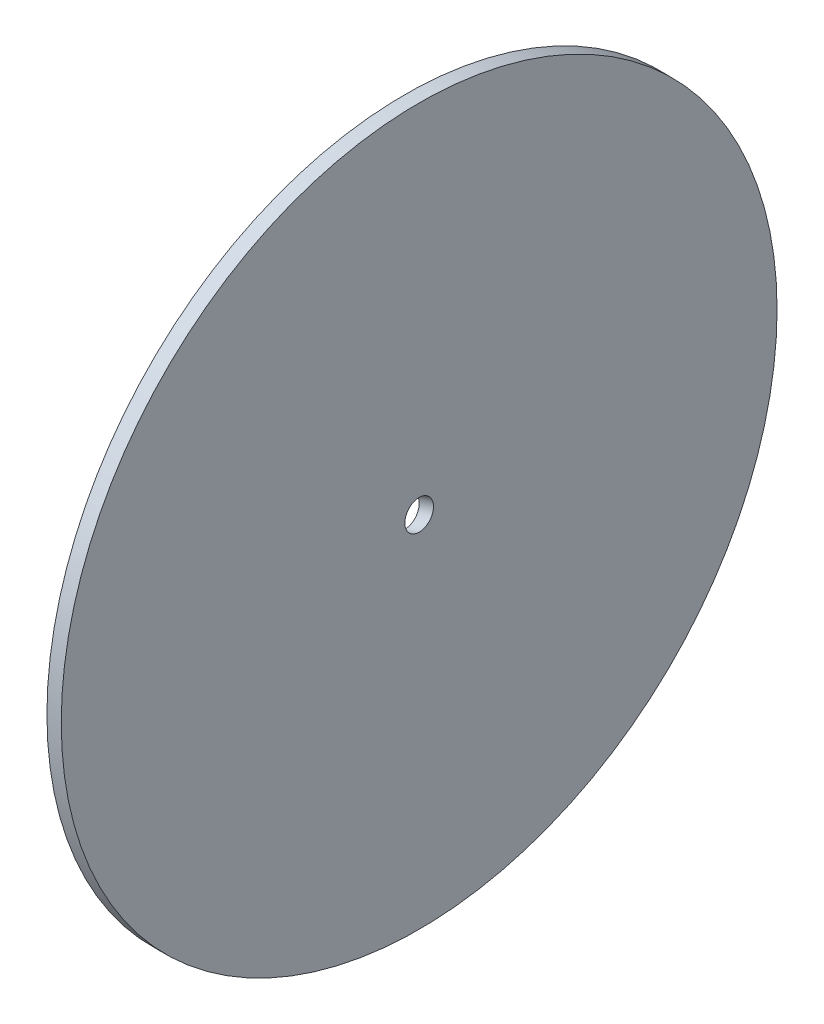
from build123d import *

# Parameters (mm, degrees)
SKETCH1_R            = 50
BOSS_EXTRUDE1_DEPTH  = 2
CUT_SWEEP1_PROFILE_R = 2


with BuildPart() as part:
    # Sketch1 → Boss-Extrude1 (new body)
    with BuildSketch(Plane(origin=(0, 0, 0), x_dir=(0, 0, -1), z_dir=(1, 0, 0))):
        Circle(SKETCH1_R)
    extrude(amount=BOSS_EXTRUDE1_DEPTH)

    # Cut-Sweep1: sweep along a path in Sketch2
    with BuildLine(Plane.XY) as cut_sweep1_path:
        Line((-20.40476177, -7.11728854), (23.40476177, 7.11728854))
    # Cut-Sweep1 profile (on start of the path) → Cut-Sweep1 (sweep, cut)
    with BuildSketch(Plane(origin=(-20.40476177, -7.11728854, 0), x_dir=(-0.309016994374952, 0.9510565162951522, 0), z_dir=(0.9510565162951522, 0.309016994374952, 0))):
        Circle(CUT_SWEEP1_PROFILE_R)
    sweep(path=cut_sweep1_path.line, mode=Mode.SUBTRACT)


solid = part.part
